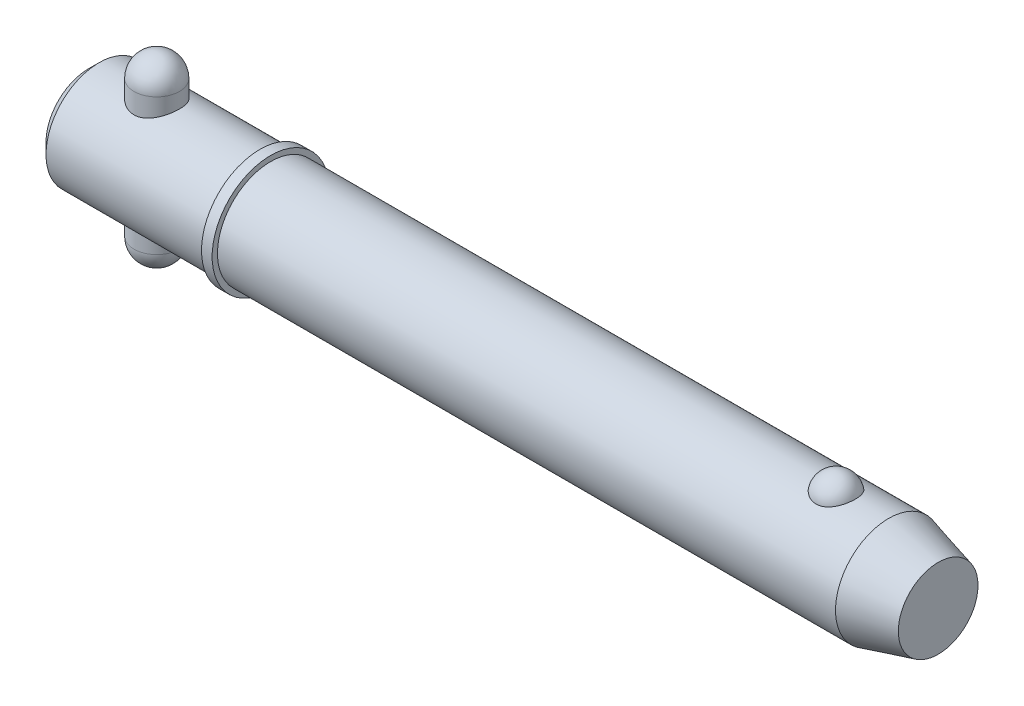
ISO-10303-21;
HEADER;
FILE_DESCRIPTION(('STEP AP214'),'2;1');
FILE_NAME('part.step','',(''),(''),'','','');
FILE_SCHEMA(('AUTOMOTIVE_DESIGN { 1 0 10303 214 1 1 1 1 }'));
ENDSEC;
DATA;
#1=APPLICATION_CONTEXT('core data for automotive mechanical design processes');
#2=APPLICATION_PROTOCOL_DEFINITION('international standard','automotive_design',2000,#1);
#3=PRODUCT_CONTEXT('',#1,'mechanical');
#4=PRODUCT('Part','Part','',(#3));
#5=PRODUCT_RELATED_PRODUCT_CATEGORY('part','',(#4));
#6=PRODUCT_DEFINITION_FORMATION('','',#4);
#7=PRODUCT_DEFINITION_CONTEXT('part definition',#1,'design');
#8=PRODUCT_DEFINITION('design','',#6,#7);
#9=PRODUCT_DEFINITION_SHAPE('','',#8);
#10=(LENGTH_UNIT() NAMED_UNIT(*) SI_UNIT(.MILLI.,.METRE.));
#11=(NAMED_UNIT(*) PLANE_ANGLE_UNIT() SI_UNIT($,.RADIAN.));
#12=(NAMED_UNIT(*) SI_UNIT($,.STERADIAN.) SOLID_ANGLE_UNIT());
#13=UNCERTAINTY_MEASURE_WITH_UNIT(LENGTH_MEASURE(1.E-05),#10,'distance_accuracy_value','');
#14=(GEOMETRIC_REPRESENTATION_CONTEXT(3) GLOBAL_UNCERTAINTY_ASSIGNED_CONTEXT((#13)) GLOBAL_UNIT_ASSIGNED_CONTEXT((#10,
#11,#12)) REPRESENTATION_CONTEXT('',''));
#15=CARTESIAN_POINT('',(0.,0.,0.));
#16=DIRECTION('',(0.,0.,1.));
#17=DIRECTION('',(1.,0.,0.));
#18=AXIS2_PLACEMENT_3D('',#15,#16,#17);
#19=CARTESIAN_POINT('',(14.28,19.05,0.));
#20=DIRECTION('',(0.,-1.,0.));
#21=DIRECTION('',(0.,0.,-1.));
#22=AXIS2_PLACEMENT_3D('',#19,#20,#21);
#23=CYLINDRICAL_SURFACE('',#22,4.76);
#24=CARTESIAN_POINT('',(14.28,-14.29,0.));
#25=DIRECTION('',(0.,-1.,0.));
#26=DIRECTION('',(0.,0.,-1.));
#27=AXIS2_PLACEMENT_3D('',#24,#25,#26);
#28=CIRCLE('',#27,4.76);
#29=CARTESIAN_POINT('',(14.28,-14.29,-4.76));
#30=VERTEX_POINT('',#29);
#31=EDGE_CURVE('P0_E10',#30,#30,#28,.F.);
#32=CARTESIAN_POINT('',(14.28,14.29,0.));
#33=DIRECTION('',(0.,-1.,0.));
#34=DIRECTION('',(0.,0.,-1.));
#35=AXIS2_PLACEMENT_3D('',#32,#33,#34);
#36=CIRCLE('',#35,4.76);
#37=CARTESIAN_POINT('',(14.28,14.29,-4.76));
#38=VERTEX_POINT('',#37);
#39=EDGE_CURVE('P0_E21',#38,#38,#36,.T.);
#40=CARTESIAN_POINT('',(14.28,-14.29,-4.76));
#41=CARTESIAN_POINT('',(14.28,-13.9922916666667,-4.76));
#42=CARTESIAN_POINT('',(14.28,-13.6945833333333,-4.76));
#43=CARTESIAN_POINT('',(14.28,-13.0991666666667,-4.76));
#44=CARTESIAN_POINT('',(14.28,-12.8014583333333,-4.76));
#45=CARTESIAN_POINT('',(14.28,-12.2060416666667,-4.76));
#46=CARTESIAN_POINT('',(14.28,-11.9083333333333,-4.76));
#47=CARTESIAN_POINT('',(14.28,-11.3129166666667,-4.76));
#48=CARTESIAN_POINT('',(14.28,-11.0152083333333,-4.76));
#49=CARTESIAN_POINT('',(14.28,-10.4197916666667,-4.76));
#50=CARTESIAN_POINT('',(14.28,-10.1220833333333,-4.76));
#51=CARTESIAN_POINT('',(14.28,-9.52666666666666,-4.76));
#52=CARTESIAN_POINT('',(14.28,-9.22895833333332,-4.76));
#53=CARTESIAN_POINT('',(14.28,-8.63354166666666,-4.76));
#54=CARTESIAN_POINT('',(14.28,-8.33583333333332,-4.76));
#55=CARTESIAN_POINT('',(14.28,-7.74041666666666,-4.76));
#56=CARTESIAN_POINT('',(14.28,-7.44270833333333,-4.76));
#57=CARTESIAN_POINT('',(14.28,-6.84729166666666,-4.76));
#58=CARTESIAN_POINT('',(14.28,-6.54958333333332,-4.76));
#59=CARTESIAN_POINT('',(14.28,-5.95416666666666,-4.76));
#60=CARTESIAN_POINT('',(14.28,-5.65645833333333,-4.76));
#61=CARTESIAN_POINT('',(14.28,-5.06104166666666,-4.76));
#62=CARTESIAN_POINT('',(14.28,-4.76333333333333,-4.76));
#63=CARTESIAN_POINT('',(14.28,-4.16791666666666,-4.76));
#64=CARTESIAN_POINT('',(14.28,-3.87020833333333,-4.76));
#65=CARTESIAN_POINT('',(14.28,-3.27479166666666,-4.76));
#66=CARTESIAN_POINT('',(14.28,-2.97708333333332,-4.76));
#67=CARTESIAN_POINT('',(14.28,-2.38166666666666,-4.76));
#68=CARTESIAN_POINT('',(14.28,-2.08395833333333,-4.76));
#69=CARTESIAN_POINT('',(14.28,-1.48854166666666,-4.76));
#70=CARTESIAN_POINT('',(14.28,-1.19083333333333,-4.76));
#71=CARTESIAN_POINT('',(14.28,-0.595416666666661,-4.76));
#72=CARTESIAN_POINT('',(14.28,-0.297708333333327,-4.76));
#73=CARTESIAN_POINT('',(14.28,0.297708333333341,-4.76));
#74=CARTESIAN_POINT('',(14.28,0.595416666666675,-4.76));
#75=CARTESIAN_POINT('',(14.28,1.19083333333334,-4.76));
#76=CARTESIAN_POINT('',(14.28,1.48854166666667,-4.76));
#77=CARTESIAN_POINT('',(14.28,2.08395833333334,-4.76));
#78=CARTESIAN_POINT('',(14.28,2.38166666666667,-4.76));
#79=CARTESIAN_POINT('',(14.28,2.97708333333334,-4.76));
#80=CARTESIAN_POINT('',(14.28,3.27479166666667,-4.76));
#81=CARTESIAN_POINT('',(14.28,3.87020833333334,-4.76));
#82=CARTESIAN_POINT('',(14.28,4.16791666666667,-4.76));
#83=CARTESIAN_POINT('',(14.28,4.76333333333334,-4.76));
#84=CARTESIAN_POINT('',(14.28,5.06104166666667,-4.76));
#85=CARTESIAN_POINT('',(14.28,5.65645833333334,-4.76));
#86=CARTESIAN_POINT('',(14.28,5.95416666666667,-4.76));
#87=CARTESIAN_POINT('',(14.28,6.54958333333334,-4.76));
#88=CARTESIAN_POINT('',(14.28,6.84729166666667,-4.76));
#89=CARTESIAN_POINT('',(14.28,7.44270833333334,-4.76));
#90=CARTESIAN_POINT('',(14.28,7.74041666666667,-4.76));
#91=CARTESIAN_POINT('',(14.28,8.33583333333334,-4.76));
#92=CARTESIAN_POINT('',(14.28,8.63354166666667,-4.76));
#93=CARTESIAN_POINT('',(14.28,9.22895833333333,-4.76));
#94=CARTESIAN_POINT('',(14.28,9.52666666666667,-4.76));
#95=CARTESIAN_POINT('',(14.28,10.1220833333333,-4.76));
#96=CARTESIAN_POINT('',(14.28,10.4197916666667,-4.76));
#97=CARTESIAN_POINT('',(14.28,11.0152083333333,-4.76));
#98=CARTESIAN_POINT('',(14.28,11.3129166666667,-4.76));
#99=CARTESIAN_POINT('',(14.28,11.9083333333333,-4.76));
#100=CARTESIAN_POINT('',(14.28,12.2060416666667,-4.76));
#101=CARTESIAN_POINT('',(14.28,12.8014583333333,-4.76));
#102=CARTESIAN_POINT('',(14.28,13.0991666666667,-4.76));
#103=CARTESIAN_POINT('',(14.28,13.6945833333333,-4.76));
#104=CARTESIAN_POINT('',(14.28,13.9922916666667,-4.76));
#105=CARTESIAN_POINT('',(14.28,14.29,-4.76));
#106=B_SPLINE_CURVE_WITH_KNOTS('',3,(#40,#41,#42,#43,#44,#45,#46,#47,#48,#49,#50,#51,#52,#53,
#54,#55,#56,#57,#58,#59,#60,#61,#62,#63,#64,#65,#66,#67,#68,#69,#70,#71,#72,#73,#74,#75,#76,#77,
#78,#79,#80,#81,#82,#83,#84,#85,#86,#87,#88,#89,#90,#91,#92,#93,#94,#95,#96,#97,#98,#99,#100,
#101,#102,#103,#104,#105),.UNSPECIFIED.,.F.,.F.,(4,2,2,2,2,2,2,2,2,2,2,2,2,2,2,2,2,2,2,2,2,2,2,
2,2,2,2,2,2,2,2,2,4),(0.,0.893125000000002,1.78625,2.67937499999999,3.5725,4.465625,5.35875,
6.25187499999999,7.145,8.038125,8.93125,9.82437499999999,10.7175,11.610625,12.50375,13.396875,
14.29,15.183125,16.07625,16.969375,17.8625,18.755625,19.64875,20.541875,21.435,22.328125,
23.22125,24.114375,25.0075,25.900625,26.79375,27.686875,28.58),.UNSPECIFIED.);
#107=EDGE_CURVE('P0_BSEAM14',#30,#38,#106,.T.);
#108=ORIENTED_EDGE('',*,*,#31,.T.);
#109=ORIENTED_EDGE('',*,*,#39,.T.);
#110=ORIENTED_EDGE('',*,*,#107,.T.);
#111=ORIENTED_EDGE('',*,*,#107,.F.);
#112=EDGE_LOOP('',(#108,#110,#109,#111));
#113=FACE_BOUND('',#112,.T.);
#114=ADVANCED_FACE('P0_F14',(#113),#23,.T.);
#115=CARTESIAN_POINT('',(14.28,-14.29,0.));
#116=DIRECTION('',(0.,0.,1.));
#117=DIRECTION('',(1.,0.,0.));
#118=AXIS2_PLACEMENT_3D('',#115,#116,#117);
#119=SPHERICAL_SURFACE('',#118,4.76);
#120=CARTESIAN_POINT('',(14.28,-14.29,0.));
#121=DIRECTION('',(0.,-1.,0.));
#122=DIRECTION('',(0.,0.,-1.));
#123=AXIS2_PLACEMENT_3D('',#120,#121,#122);
#124=SPHERICAL_SURFACE('',#123,4.76);
#125=ORIENTED_EDGE('',*,*,#31,.F.);
#126=EDGE_LOOP('',(#125));
#127=FACE_BOUND('',#126,.T.);
#128=ADVANCED_FACE('P0_F29',(#127),#124,.T.);
#129=CARTESIAN_POINT('',(14.28,14.29,0.));
#130=DIRECTION('',(0.,0.,1.));
#131=DIRECTION('',(1.,0.,0.));
#132=AXIS2_PLACEMENT_3D('',#129,#130,#131);
#133=SPHERICAL_SURFACE('',#132,4.76);
#134=CARTESIAN_POINT('',(14.28,14.29,0.));
#135=DIRECTION('',(0.,-1.,0.));
#136=DIRECTION('',(0.,0.,-1.));
#137=AXIS2_PLACEMENT_3D('',#134,#135,#136);
#138=SPHERICAL_SURFACE('',#137,4.76);
#139=ORIENTED_EDGE('',*,*,#39,.F.);
#140=EDGE_LOOP('',(#139));
#141=FACE_BOUND('',#140,.T.);
#142=ADVANCED_FACE('P0_F16',(#141),#138,.T.);
#143=CLOSED_SHELL('',(#114,#128,#142));
#144=MANIFOLD_SOLID_BREP('P0_B1',#143);
#145=CARTESIAN_POINT('',(0.,0.,0.));
#146=DIRECTION('',(1.,0.,0.));
#147=DIRECTION('',(0.,0.,-1.));
#148=AXIS2_PLACEMENT_3D('',#145,#146,#147);
#149=CYLINDRICAL_SURFACE('',#148,11.115);
#150=CARTESIAN_POINT('',(167.429563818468,0.,0.));
#151=DIRECTION('',(1.,0.,0.));
#152=DIRECTION('',(0.,0.,-1.));
#153=AXIS2_PLACEMENT_3D('',#150,#151,#152);
#154=CIRCLE('',#153,11.115);
#155=CARTESIAN_POINT('',(167.429563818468,0.,-11.115));
#156=VERTEX_POINT('',#155);
#157=EDGE_CURVE('P1_E81',#156,#156,#154,.T.);
#158=ORIENTED_EDGE('',*,*,#157,.F.);
#159=EDGE_LOOP('',(#158));
#160=FACE_BOUND('',#159,.T.);
#161=CARTESIAN_POINT('',(38.1,0.,0.));
#162=DIRECTION('',(1.,0.,0.));
#163=DIRECTION('',(0.,0.,-1.));
#164=AXIS2_PLACEMENT_3D('',#161,#162,#163);
#165=CIRCLE('',#164,11.115);
#166=CARTESIAN_POINT('',(38.1,0.,-11.115));
#167=VERTEX_POINT('',#166);
#168=EDGE_CURVE('P1_E85',#167,#167,#165,.T.);
#169=ORIENTED_EDGE('',*,*,#168,.T.);
#170=EDGE_LOOP('',(#169));
#171=FACE_BOUND('',#170,.T.);
#172=CARTESIAN_POINT('',(156.431068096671,10.3028087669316,4.17077409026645));
#173=CARTESIAN_POINT('',(156.214775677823,10.3028003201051,4.17078240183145));
#174=CARTESIAN_POINT('',(155.998548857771,10.3098895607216,4.15340593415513));
#175=CARTESIAN_POINT('',(155.572540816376,10.3373834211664,4.08449540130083));
#176=CARTESIAN_POINT('',(155.362757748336,10.3577841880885,4.0329712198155));
#177=CARTESIAN_POINT('',(154.955782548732,10.4095237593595,3.89746513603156));
#178=CARTESIAN_POINT('',(154.758572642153,10.4408466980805,3.81353029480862));
#179=CARTESIAN_POINT('',(154.381338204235,10.5110236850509,3.61560339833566));
#180=CARTESIAN_POINT('',(154.201317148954,10.5498792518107,3.50160528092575));
#181=CARTESIAN_POINT('',(153.857684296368,10.6322884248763,3.24292464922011));
#182=CARTESIAN_POINT('',(153.694686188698,10.6759443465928,3.09746040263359));
#183=CARTESIAN_POINT('',(153.394591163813,10.7625291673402,2.7817192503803));
#184=CARTESIAN_POINT('',(153.257499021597,10.8054579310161,2.61143778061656));
#185=CARTESIAN_POINT('',(153.006408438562,10.8881935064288,2.24226695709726));
#186=CARTESIAN_POINT('',(152.893710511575,10.9277761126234,2.04244123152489));
#187=CARTESIAN_POINT('',(152.701777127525,10.997484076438,1.62578254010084));
#188=CARTESIAN_POINT('',(152.622544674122,11.0276085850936,1.40894804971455));
#189=CARTESIAN_POINT('',(152.498303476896,11.0756732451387,0.961250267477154));
#190=CARTESIAN_POINT('',(152.453760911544,11.0934470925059,0.730239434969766));
#191=CARTESIAN_POINT('',(152.401569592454,11.1143331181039,0.263439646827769));
#192=CARTESIAN_POINT('',(152.393920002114,11.1174456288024,0.0276507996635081));
#193=CARTESIAN_POINT('',(152.41561056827,11.1087161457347,-0.440729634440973));
#194=CARTESIAN_POINT('',(152.444762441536,11.0969502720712,-0.6733313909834));
#195=CARTESIAN_POINT('',(152.539143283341,11.0597872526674,-1.12996621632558));
#196=CARTESIAN_POINT('',(152.604372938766,11.0343898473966,-1.35399912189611));
#197=CARTESIAN_POINT('',(152.76969844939,10.972515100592,-1.78750286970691));
#198=CARTESIAN_POINT('',(152.86983863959,10.9360236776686,-1.99695478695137));
#199=CARTESIAN_POINT('',(153.102940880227,10.8557595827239,-2.39520667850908));
#200=CARTESIAN_POINT('',(153.235905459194,10.8119863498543,-2.58400506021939));
#201=CARTESIAN_POINT('',(153.532407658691,10.7216733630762,-2.93635726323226));
#202=CARTESIAN_POINT('',(153.696056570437,10.675123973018,-3.09981510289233));
#203=CARTESIAN_POINT('',(154.049860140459,10.5846571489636,-3.39592247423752));
#204=CARTESIAN_POINT('',(154.240012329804,10.5407394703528,-3.52857487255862));
#205=CARTESIAN_POINT('',(154.63750141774,10.4616690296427,-3.75646057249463));
#206=CARTESIAN_POINT('',(154.84436705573,10.4263443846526,-3.85245432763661));
#207=CARTESIAN_POINT('',(155.272954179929,10.3675574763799,-4.00798747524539));
#208=CARTESIAN_POINT('',(155.494670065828,10.344090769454,-4.0675405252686));
#209=CARTESIAN_POINT('',(155.934669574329,10.3128282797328,-4.14614314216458));
#210=CARTESIAN_POINT('',(156.152565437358,10.3043040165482,-4.1670783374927));
#211=CARTESIAN_POINT('',(156.58894951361,10.3016771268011,-4.17357158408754));
#212=CARTESIAN_POINT('',(156.807437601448,10.3075716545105,-4.15913661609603));
#213=CARTESIAN_POINT('',(157.231744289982,10.3326686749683,-4.09636961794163));
#214=CARTESIAN_POINT('',(157.437745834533,10.3514555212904,-4.0490957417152));
#215=CARTESIAN_POINT('',(157.838576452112,10.399818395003,-3.92320197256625));
#216=CARTESIAN_POINT('',(158.0334046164,10.4293952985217,-3.84457953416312));
#217=CARTESIAN_POINT('',(158.411191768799,10.4969600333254,-3.65612410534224));
#218=CARTESIAN_POINT('',(158.593797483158,10.5351178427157,-3.54564545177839));
#219=CARTESIAN_POINT('',(158.938204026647,10.6154999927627,-3.29718036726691));
#220=CARTESIAN_POINT('',(159.100000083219,10.657725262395,-3.15918764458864));
#221=CARTESIAN_POINT('',(159.406959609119,10.744212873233,-2.85163580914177));
#222=CARTESIAN_POINT('',(159.550891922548,10.7884718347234,-2.68084605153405));
#223=CARTESIAN_POINT('',(159.809237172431,10.872374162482,-2.31721864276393));
#224=CARTESIAN_POINT('',(159.923644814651,10.9120167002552,-2.12437704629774));
#225=CARTESIAN_POINT('',(160.123873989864,10.9838919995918,-1.71516999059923));
#226=CARTESIAN_POINT('',(160.20866178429,11.0158465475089,-1.49824866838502));
#227=CARTESIAN_POINT('',(160.34268382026,11.0673523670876,-1.05228572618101));
#228=CARTESIAN_POINT('',(160.391917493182,11.086903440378,-0.823243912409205));
#229=CARTESIAN_POINT('',(160.453891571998,11.1116323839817,-0.359087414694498));
#230=CARTESIAN_POINT('',(160.466566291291,11.1167843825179,-0.123962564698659));
#231=CARTESIAN_POINT('',(160.454973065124,11.1121144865,0.345220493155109));
#232=CARTESIAN_POINT('',(160.430705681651,11.1022928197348,0.579278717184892));
#233=CARTESIAN_POINT('',(160.345907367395,11.0687504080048,1.03866534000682));
#234=CARTESIAN_POINT('',(160.285529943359,11.0450885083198,1.26402641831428));
#235=CARTESIAN_POINT('',(160.129853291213,10.9863185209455,1.70076772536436));
#236=CARTESIAN_POINT('',(160.034551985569,10.9512097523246,1.91214712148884));
#237=CARTESIAN_POINT('',(159.810397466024,10.8729733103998,2.316083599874));
#238=CARTESIAN_POINT('',(159.681380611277,10.8298068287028,2.50854240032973));
#239=CARTESIAN_POINT('',(159.392732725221,10.7401896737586,2.86808766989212));
#240=CARTESIAN_POINT('',(159.233102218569,10.6937390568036,3.03517457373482));
#241=CARTESIAN_POINT('',(158.887534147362,10.6029321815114,3.33857581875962));
#242=CARTESIAN_POINT('',(158.701708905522,10.5585680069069,3.47501541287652));
#243=CARTESIAN_POINT('',(158.307875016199,10.4769321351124,3.71390897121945));
#244=CARTESIAN_POINT('',(158.099863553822,10.439661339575,3.81635861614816));
#245=CARTESIAN_POINT('',(157.654066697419,10.3749407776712,3.98910631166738));
#246=CARTESIAN_POINT('',(157.415234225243,10.3482457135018,4.05700929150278));
#247=CARTESIAN_POINT('',(156.927925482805,10.312188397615,4.14782844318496));
#248=CARTESIAN_POINT('',(156.679453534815,10.3028184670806,4.17076454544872));
#249=CARTESIAN_POINT('',(156.431068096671,10.3028087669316,4.17077409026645));
#250=B_SPLINE_CURVE_WITH_KNOTS('',3,(#172,#173,#174,#175,#176,#177,#178,#179,#180,#181,#182,
#183,#184,#185,#186,#187,#188,#189,#190,#191,#192,#193,#194,#195,#196,#197,#198,#199,#200,#201,
#202,#203,#204,#205,#206,#207,#208,#209,#210,#211,#212,#213,#214,#215,#216,#217,#218,#219,#220,
#221,#222,#223,#224,#225,#226,#227,#228,#229,#230,#231,#232,#233,#234,#235,#236,#237,#238,#239,
#240,#241,#242,#243,#244,#245,#246,#247,#248,#249),.UNSPECIFIED.,.T.,.F.,(4,2,2,2,2,2,2,2,2,2,2,
2,2,2,2,2,2,2,2,2,2,2,2,2,2,2,2,2,2,2,2,2,2,2,2,2,2,2,4),(0.,0.64796614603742,1.29574482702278,
1.9425864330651,2.58955857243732,3.25496465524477,3.92049326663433,4.61566368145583,
5.31089647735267,6.01531821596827,6.71972398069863,7.42054043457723,8.12137023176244,
8.82309331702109,9.52487047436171,10.2292439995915,10.9335519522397,11.6223330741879,
12.3108558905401,12.9647664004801,13.6185478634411,14.252184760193,14.8858731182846,
15.5334360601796,16.1811472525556,16.8611459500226,17.5412664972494,18.2431855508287,
18.9451158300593,19.6483065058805,20.3514864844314,21.0516982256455,21.7519516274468,
22.4556690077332,23.1593743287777,23.860149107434,24.5610129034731,25.3054529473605,
26.049562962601),.UNSPECIFIED.);
#251=CARTESIAN_POINT('',(156.431068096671,10.3028087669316,4.17077409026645));
#252=VERTEX_POINT('',#251);
#253=EDGE_CURVE('P1_E35',#252,#252,#250,.T.);
#254=ORIENTED_EDGE('',*,*,#253,.T.);
#255=EDGE_LOOP('',(#254));
#256=FACE_BOUND('',#255,.T.);
#257=ADVANCED_FACE('P1_F13',(#160,#171,#256),#149,.T.);
#258=CARTESIAN_POINT('',(0.,0.,0.));
#259=DIRECTION('',(-1.,0.,0.));
#260=DIRECTION('',(0.,0.,1.));
#261=AXIS2_PLACEMENT_3D('',#258,#259,#260);
#262=PLANE('',#261);
#263=CARTESIAN_POINT('',(0.,0.,0.));
#264=DIRECTION('',(1.,0.,0.));
#265=DIRECTION('',(0.,0.,-1.));
#266=AXIS2_PLACEMENT_3D('',#263,#264,#265);
#267=CIRCLE('',#266,8.892);
#268=CARTESIAN_POINT('',(0.,0.,-8.892));
#269=VERTEX_POINT('',#268);
#270=EDGE_CURVE('P1_E9',#269,#269,#267,.T.);
#271=ORIENTED_EDGE('',*,*,#270,.F.);
#272=EDGE_LOOP('',(#271));
#273=FACE_BOUND('',#272,.T.);
#274=ADVANCED_FACE('P1_F15',(#273),#262,.T.);
#275=CARTESIAN_POINT('',(2.22299999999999,0.,0.));
#276=DIRECTION('',(1.,0.,0.));
#277=DIRECTION('',(0.,0.,-1.));
#278=AXIS2_PLACEMENT_3D('',#275,#276,#277);
#279=CONICAL_SURFACE('',#278,11.115,0.78539816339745);
#280=ORIENTED_EDGE('',*,*,#270,.T.);
#281=EDGE_LOOP('',(#280));
#282=FACE_BOUND('',#281,.T.);
#283=CARTESIAN_POINT('',(2.22299999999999,0.,0.));
#284=DIRECTION('',(1.,0.,0.));
#285=DIRECTION('',(0.,0.,-1.));
#286=AXIS2_PLACEMENT_3D('',#283,#284,#285);
#287=CIRCLE('',#286,11.115);
#288=CARTESIAN_POINT('',(2.22299999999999,0.,-11.115));
#289=VERTEX_POINT('',#288);
#290=EDGE_CURVE('P1_E26',#289,#289,#287,.T.);
#291=ORIENTED_EDGE('',*,*,#290,.F.);
#292=EDGE_LOOP('',(#291));
#293=FACE_BOUND('',#292,.T.);
#294=ADVANCED_FACE('P1_F77',(#282,#293),#279,.T.);
#295=CARTESIAN_POINT('',(0.,0.,0.));
#296=DIRECTION('',(1.,0.,0.));
#297=DIRECTION('',(0.,0.,-1.));
#298=AXIS2_PLACEMENT_3D('',#295,#296,#297);
#299=CYLINDRICAL_SURFACE('',#298,11.115);
#300=CARTESIAN_POINT('',(14.28,-10.0441836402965,4.76));
#301=CARTESIAN_POINT('',(14.1533731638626,-10.0441846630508,4.75999904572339));
#302=CARTESIAN_POINT('',(14.0267055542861,-10.0465865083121,4.75493985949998));
#303=CARTESIAN_POINT('',(13.774298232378,-10.0561141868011,4.73475585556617));
#304=CARTESIAN_POINT('',(13.6485591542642,-10.0632429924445,4.71962470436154));
#305=CARTESIAN_POINT('',(13.3987500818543,-10.0819979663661,4.67942666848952));
#306=CARTESIAN_POINT('',(13.2746840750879,-10.0936334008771,4.65433930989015));
#307=CARTESIAN_POINT('',(13.0293244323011,-10.1210146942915,4.59449317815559));
#308=CARTESIAN_POINT('',(12.9080319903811,-10.1367622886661,4.55973032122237));
#309=CARTESIAN_POINT('',(12.669614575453,-10.1717810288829,4.48106435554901));
#310=CARTESIAN_POINT('',(12.5524727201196,-10.1910352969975,4.4372048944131));
#311=CARTESIAN_POINT('',(12.3224300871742,-10.2325403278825,4.34063417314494));
#312=CARTESIAN_POINT('',(12.2095309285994,-10.2547922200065,4.28791957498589));
#313=CARTESIAN_POINT('',(11.8782785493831,-10.3250879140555,4.11715127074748));
#314=CARTESIAN_POINT('',(11.6670799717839,-10.3767168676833,3.98637638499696));
#315=CARTESIAN_POINT('',(11.2564039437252,-10.4874309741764,3.68567149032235));
#316=CARTESIAN_POINT('',(11.0583793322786,-10.5467772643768,3.51386978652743));
#317=CARTESIAN_POINT('',(10.6927724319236,-10.6641377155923,3.13969960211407));
#318=CARTESIAN_POINT('',(10.5252022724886,-10.7221513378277,2.93731900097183));
#319=CARTESIAN_POINT('',(10.2965609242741,-10.8050020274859,2.60935726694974));
#320=CARTESIAN_POINT('',(10.2227768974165,-10.8324811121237,2.49310321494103));
#321=CARTESIAN_POINT('',(10.0853380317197,-10.884703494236,2.25418999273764));
#322=CARTESIAN_POINT('',(10.0216789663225,-10.9094479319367,2.13153352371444));
#323=CARTESIAN_POINT('',(9.90506238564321,-10.9554932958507,1.88060370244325));
#324=CARTESIAN_POINT('',(9.85210574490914,-10.9767939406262,1.7523298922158));
#325=CARTESIAN_POINT('',(9.75746464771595,-11.0153112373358,1.49115740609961));
#326=CARTESIAN_POINT('',(9.71577447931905,-11.0325299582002,1.35826111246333));
#327=CARTESIAN_POINT('',(9.64605475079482,-11.0615607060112,1.09614539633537));
#328=CARTESIAN_POINT('',(9.61740732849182,-11.0736151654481,0.96711700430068));
#329=CARTESIAN_POINT('',(9.57092026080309,-11.0932687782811,0.706847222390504));
#330=CARTESIAN_POINT('',(9.55307574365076,-11.1008699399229,0.575606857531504));
#331=CARTESIAN_POINT('',(9.52838640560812,-11.1114054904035,0.31192917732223));
#332=CARTESIAN_POINT('',(9.52153986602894,-11.114340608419,0.179492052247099));
#333=CARTESIAN_POINT('',(9.51892405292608,-11.1154607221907,-0.0855090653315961));
#334=CARTESIAN_POINT('',(9.52315432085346,-11.1136459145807,-0.218073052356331));
#335=CARTESIAN_POINT('',(9.542009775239,-11.1055891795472,-0.473709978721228));
#336=CARTESIAN_POINT('',(9.55594693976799,-11.099640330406,-0.596843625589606));
#337=CARTESIAN_POINT('',(9.59332832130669,-11.0837823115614,-0.841440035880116));
#338=CARTESIAN_POINT('',(9.61677567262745,-11.0738718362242,-0.962902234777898));
#339=CARTESIAN_POINT('',(9.67294089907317,-11.0503378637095,-1.20325684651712));
#340=CARTESIAN_POINT('',(9.70565569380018,-11.0367156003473,-1.32215009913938));
#341=CARTESIAN_POINT('',(9.78005008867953,-11.0060908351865,-1.55666640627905));
#342=CARTESIAN_POINT('',(9.82173311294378,-10.9890870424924,-1.67228819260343));
#343=CARTESIAN_POINT('',(9.96110379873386,-10.9330280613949,-2.01656166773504));
#344=CARTESIAN_POINT('',(10.0722987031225,-10.8892801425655,-2.23915547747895));
#345=CARTESIAN_POINT('',(10.3268588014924,-10.7934745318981,-2.66299199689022));
#346=CARTESIAN_POINT('',(10.4702355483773,-10.7414138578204,-2.86422700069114));
#347=CARTESIAN_POINT('',(10.7973904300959,-10.6296201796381,-3.25557775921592));
#348=CARTESIAN_POINT('',(10.9833705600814,-10.569604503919,-3.443774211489));
#349=CARTESIAN_POINT('',(11.3844486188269,-10.4514707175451,-3.78722133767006));
#350=CARTESIAN_POINT('',(11.5995590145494,-10.3933534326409,-3.94245783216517));
#351=CARTESIAN_POINT('',(11.9444340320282,-10.311516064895,-4.14990014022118));
#352=CARTESIAN_POINT('',(12.0654579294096,-10.2847012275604,-4.21573894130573));
#353=CARTESIAN_POINT('',(12.3132718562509,-10.2342051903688,-4.33688518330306));
#354=CARTESIAN_POINT('',(12.4400593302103,-10.2105226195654,-4.39219723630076));
#355=CARTESIAN_POINT('',(12.6985418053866,-10.1671237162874,-4.49174500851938));
#356=CARTESIAN_POINT('',(12.8302359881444,-10.1474067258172,-4.53598256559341));
#357=CARTESIAN_POINT('',(13.0975061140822,-10.1126841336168,-4.61287629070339));
#358=CARTESIAN_POINT('',(13.233079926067,-10.0976759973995,-4.64553869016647));
#359=CARTESIAN_POINT('',(13.4978553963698,-10.0737863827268,-4.6971059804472));
#360=CARTESIAN_POINT('',(13.6268754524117,-10.0645618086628,-4.716785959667));
#361=CARTESIAN_POINT('',(13.8862990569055,-10.051062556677,-4.74548419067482));
#362=CARTESIAN_POINT('',(14.0167019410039,-10.0467856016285,-4.75450734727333));
#363=CARTESIAN_POINT('',(14.277859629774,-10.0433352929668,-4.76179143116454));
#364=CARTESIAN_POINT('',(14.4086143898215,-10.0441613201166,-4.76005366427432));
#365=CARTESIAN_POINT('',(14.6694025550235,-10.0508838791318,-4.74584231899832));
#366=CARTESIAN_POINT('',(14.7994359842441,-10.0567802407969,-4.73336910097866));
#367=CARTESIAN_POINT('',(15.0487369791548,-10.0728449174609,-4.69907984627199));
#368=CARTESIAN_POINT('',(15.1681238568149,-10.0826872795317,-4.67797462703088));
#369=CARTESIAN_POINT('',(15.4045894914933,-10.1062580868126,-4.62682977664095));
#370=CARTESIAN_POINT('',(15.5216674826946,-10.1199877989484,-4.59678723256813));
#371=CARTESIAN_POINT('',(15.868278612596,-10.1664161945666,-4.49365911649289));
#372=CARTESIAN_POINT('',(16.0933756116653,-10.2043671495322,-4.40754694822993));
#373=CARTESIAN_POINT('',(16.5357981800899,-10.2919879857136,-4.19898201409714));
#374=CARTESIAN_POINT('',(16.7523611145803,-10.3420954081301,-4.07511281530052));
#375=CARTESIAN_POINT('',(17.1627188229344,-10.4477911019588,-3.7959429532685));
#376=CARTESIAN_POINT('',(17.3565033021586,-10.5033818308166,-3.64062816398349));
#377=CARTESIAN_POINT('',(17.7334034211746,-10.6196376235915,-3.28693729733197));
#378=CARTESIAN_POINT('',(17.9141276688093,-10.6803237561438,-3.08599175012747));
#379=CARTESIAN_POINT('',(18.1582189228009,-10.7666348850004,-2.76320365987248));
#380=CARTESIAN_POINT('',(18.2351223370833,-10.7946346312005,-2.65197124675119));
#381=CARTESIAN_POINT('',(18.3793967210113,-10.8483267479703,-2.42297927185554));
#382=CARTESIAN_POINT('',(18.4467718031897,-10.87402011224,-2.30522255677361));
#383=CARTESIAN_POINT('',(18.5717669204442,-10.9225249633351,-2.06324665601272));
#384=CARTESIAN_POINT('',(18.6293326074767,-10.9453202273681,-1.93899615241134));
#385=CARTESIAN_POINT('',(18.73370006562,-10.9872100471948,-1.6855059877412));
#386=CARTESIAN_POINT('',(18.7805065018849,-11.0063062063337,-1.55626851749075));
#387=CARTESIAN_POINT('',(18.8628731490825,-11.0402419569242,-1.29375150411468));
#388=CARTESIAN_POINT('',(18.8984366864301,-11.0550828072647,-1.16047316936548));
#389=CARTESIAN_POINT('',(18.9579183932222,-11.0800638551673,-0.890912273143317));
#390=CARTESIAN_POINT('',(18.9818374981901,-11.0902044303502,-0.75462995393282));
#391=CARTESIAN_POINT('',(19.0164177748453,-11.104911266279,-0.490295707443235));
#392=CARTESIAN_POINT('',(19.027922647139,-11.1098318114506,-0.362373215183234));
#393=CARTESIAN_POINT('',(19.040554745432,-11.1152360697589,-0.105876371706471));
#394=CARTESIAN_POINT('',(19.0416784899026,-11.1157182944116,0.0226981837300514));
#395=CARTESIAN_POINT('',(19.0335275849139,-11.1122291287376,0.27938352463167));
#396=CARTESIAN_POINT('',(19.0242587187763,-11.1082602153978,0.407494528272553));
#397=CARTESIAN_POINT('',(18.9954320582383,-11.0959792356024,0.662388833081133));
#398=CARTESIAN_POINT('',(18.9758704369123,-11.0876655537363,0.789171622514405));
#399=CARTESIAN_POINT('',(18.9276379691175,-11.0673259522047,1.03545890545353));
#400=CARTESIAN_POINT('',(18.8993573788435,-11.0554596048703,1.15505309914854));
#401=CARTESIAN_POINT('',(18.8337694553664,-11.0282166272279,1.39134516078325));
#402=CARTESIAN_POINT('',(18.7964589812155,-11.0128387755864,1.5080420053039));
#403=CARTESIAN_POINT('',(18.671464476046,-10.9619666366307,1.85262797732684));
#404=CARTESIAN_POINT('',(18.5706772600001,-10.9217161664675,2.07521484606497));
#405=CARTESIAN_POINT('',(18.33202463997,-10.8301378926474,2.51061719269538));
#406=CARTESIAN_POINT('',(18.1926775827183,-10.7783885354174,2.72252375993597));
#407=CARTESIAN_POINT('',(17.8829747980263,-10.669863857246,3.12088015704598));
#408=CARTESIAN_POINT('',(17.7126068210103,-10.6130865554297,3.30731987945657));
#409=CARTESIAN_POINT('',(17.3310036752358,-10.495668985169,3.66358491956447));
#410=CARTESIAN_POINT('',(17.1177010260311,-10.4350471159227,3.83122543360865));
#411=CARTESIAN_POINT('',(16.7778915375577,-10.3495418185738,4.05420569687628));
#412=CARTESIAN_POINT('',(16.6612023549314,-10.3219229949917,4.12383380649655));
#413=CARTESIAN_POINT('',(16.4218466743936,-10.2693487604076,4.25306463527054));
#414=CARTESIAN_POINT('',(16.2991829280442,-10.2443921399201,4.31267191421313));
#415=CARTESIAN_POINT('',(16.0488008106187,-10.1979981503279,4.42126071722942));
#416=CARTESIAN_POINT('',(15.9210894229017,-10.1765561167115,4.47025635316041));
#417=CARTESIAN_POINT('',(15.6613937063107,-10.1379191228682,4.55720152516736));
#418=CARTESIAN_POINT('',(15.5294115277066,-10.1207220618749,4.59515652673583));
#419=CARTESIAN_POINT('',(15.2624981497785,-10.091252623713,4.65951684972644));
#420=CARTESIAN_POINT('',(15.1275757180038,-10.0789672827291,4.68595259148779));
#421=CARTESIAN_POINT('',(14.8556442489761,-10.0597530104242,4.72706206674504));
#422=CARTESIAN_POINT('',(14.7186368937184,-10.0528199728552,4.74174481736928));
#423=CARTESIAN_POINT('',(14.5310955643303,-10.047196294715,4.75363843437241));
#424=CARTESIAN_POINT('',(14.48091543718,-10.0460674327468,4.75602323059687));
#425=CARTESIAN_POINT('',(14.3804923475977,-10.044560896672,4.7592042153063));
#426=CARTESIAN_POINT('',(14.3302493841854,-10.0441832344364,4.76000037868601));
#427=CARTESIAN_POINT('',(14.28,-10.0441836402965,4.76));
#428=B_SPLINE_CURVE_WITH_KNOTS('',3,(#300,#301,#302,#303,#304,#305,#306,#307,#308,#309,#310,
#311,#312,#313,#314,#315,#316,#317,#318,#319,#320,#321,#322,#323,#324,#325,#326,#327,#328,#329,
#330,#331,#332,#333,#334,#335,#336,#337,#338,#339,#340,#341,#342,#343,#344,#345,#346,#347,#348,
#349,#350,#351,#352,#353,#354,#355,#356,#357,#358,#359,#360,#361,#362,#363,#364,#365,#366,#367,
#368,#369,#370,#371,#372,#373,#374,#375,#376,#377,#378,#379,#380,#381,#382,#383,#384,#385,#386,
#387,#388,#389,#390,#391,#392,#393,#394,#395,#396,#397,#398,#399,#400,#401,#402,#403,#404,#405,
#406,#407,#408,#409,#410,#411,#412,#413,#414,#415,#416,#417,#418,#419,#420,#421,#422,#423,#424,
#425,#426,#427),.UNSPECIFIED.,.T.,.F.,(4,2,2,2,2,2,2,2,2,2,2,2,2,2,2,2,2,2,2,2,2,2,2,2,2,2,2,2,
2,2,2,2,2,2,2,2,2,2,2,2,2,2,2,2,2,2,2,2,2,2,2,2,2,2,2,2,2,2,2,2,2,2,2,4),(0.,0.379828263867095,
0.759895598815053,1.14074858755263,1.52176256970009,1.90098898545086,2.28035867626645,
3.03818035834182,3.84125131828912,4.6446414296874,5.06541657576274,5.48601561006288,
5.90664899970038,6.3270687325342,6.72470503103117,7.12216187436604,7.51955659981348,
7.91693487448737,8.28868404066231,8.66055582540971,9.03230414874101,9.40419465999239,
10.1585834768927,10.9132435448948,11.7236471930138,12.5343987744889,12.9550196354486,
13.3754557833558,13.7958221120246,14.2159617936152,14.6079540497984,14.9997658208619,
15.3915300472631,15.7832811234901,16.1477615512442,16.512360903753,17.240999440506,
18.0012974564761,18.761937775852,19.5886929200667,20.0025782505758,20.4162843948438,
20.832212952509,21.2479608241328,21.6635855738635,22.0791769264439,22.4642880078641,
22.8495282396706,23.2345541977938,23.6197234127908,23.9896813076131,24.3597680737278,
25.099327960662,25.8726239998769,26.6462260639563,27.4759193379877,27.8914891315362,
28.3068693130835,28.7216936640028,29.1363123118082,29.5498292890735,29.9630287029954,
30.113753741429,30.2644811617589),.UNSPECIFIED.);
#429=CARTESIAN_POINT('',(14.28,-10.0441836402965,4.76));
#430=VERTEX_POINT('',#429);
#431=EDGE_CURVE('P1_E17',#430,#430,#428,.T.);
#432=ORIENTED_EDGE('',*,*,#431,.F.);
#433=EDGE_LOOP('',(#432));
#434=FACE_BOUND('',#433,.T.);
#435=CARTESIAN_POINT('',(14.28,10.0441836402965,4.76));
#436=CARTESIAN_POINT('',(14.4066268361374,10.0441846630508,4.75999904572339));
#437=CARTESIAN_POINT('',(14.5332944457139,10.0465865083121,4.75493985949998));
#438=CARTESIAN_POINT('',(14.785701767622,10.0561141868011,4.73475585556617));
#439=CARTESIAN_POINT('',(14.9114408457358,10.0632429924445,4.71962470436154));
#440=CARTESIAN_POINT('',(15.1612499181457,10.0819979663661,4.67942666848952));
#441=CARTESIAN_POINT('',(15.2853159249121,10.0936334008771,4.65433930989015));
#442=CARTESIAN_POINT('',(15.5306755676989,10.1210146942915,4.59449317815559));
#443=CARTESIAN_POINT('',(15.6519680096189,10.1367622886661,4.55973032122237));
#444=CARTESIAN_POINT('',(15.890385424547,10.1717810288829,4.48106435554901));
#445=CARTESIAN_POINT('',(16.0075272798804,10.1910352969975,4.4372048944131));
#446=CARTESIAN_POINT('',(16.2375699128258,10.2325403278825,4.34063417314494));
#447=CARTESIAN_POINT('',(16.3504690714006,10.2547922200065,4.28791957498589));
#448=CARTESIAN_POINT('',(16.6817214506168,10.3250879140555,4.11715127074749));
#449=CARTESIAN_POINT('',(16.8929200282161,10.3767168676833,3.98637638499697));
#450=CARTESIAN_POINT('',(17.3035960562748,10.4874309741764,3.68567149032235));
#451=CARTESIAN_POINT('',(17.5016206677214,10.5467772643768,3.51386978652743));
#452=CARTESIAN_POINT('',(17.8672275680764,10.6641377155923,3.13969960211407));
#453=CARTESIAN_POINT('',(18.0347977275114,10.7221513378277,2.93731900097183));
#454=CARTESIAN_POINT('',(18.2634390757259,10.8050020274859,2.60935726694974));
#455=CARTESIAN_POINT('',(18.3372231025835,10.8324811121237,2.49310321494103));
#456=CARTESIAN_POINT('',(18.4746619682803,10.884703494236,2.25418999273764));
#457=CARTESIAN_POINT('',(18.5383210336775,10.9094479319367,2.13153352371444));
#458=CARTESIAN_POINT('',(18.6549376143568,10.9554932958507,1.88060370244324));
#459=CARTESIAN_POINT('',(18.7078942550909,10.9767939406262,1.75232989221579));
#460=CARTESIAN_POINT('',(18.8025353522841,11.0153112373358,1.4911574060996));
#461=CARTESIAN_POINT('',(18.844225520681,11.0325299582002,1.35826111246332));
#462=CARTESIAN_POINT('',(18.9139452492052,11.0615607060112,1.09614539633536));
#463=CARTESIAN_POINT('',(18.9425926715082,11.0736151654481,0.967117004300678));
#464=CARTESIAN_POINT('',(18.9890797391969,11.0932687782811,0.706847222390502));
#465=CARTESIAN_POINT('',(19.0069242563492,11.1008699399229,0.575606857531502));
#466=CARTESIAN_POINT('',(19.0316135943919,11.1114054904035,0.311929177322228));
#467=CARTESIAN_POINT('',(19.0384601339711,11.114340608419,0.179492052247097));
#468=CARTESIAN_POINT('',(19.0410759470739,11.1154607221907,-0.0855090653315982));
#469=CARTESIAN_POINT('',(19.0368456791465,11.1136459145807,-0.218073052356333));
#470=CARTESIAN_POINT('',(19.017990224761,11.1055891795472,-0.47370997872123));
#471=CARTESIAN_POINT('',(19.004053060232,11.099640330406,-0.596843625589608));
#472=CARTESIAN_POINT('',(18.9666716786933,11.0837823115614,-0.841440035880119));
#473=CARTESIAN_POINT('',(18.9432243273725,11.0738718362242,-0.9629022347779));
#474=CARTESIAN_POINT('',(18.8870591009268,11.0503378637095,-1.20325684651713));
#475=CARTESIAN_POINT('',(18.8543443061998,11.0367156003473,-1.32215009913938));
#476=CARTESIAN_POINT('',(18.7799499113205,11.0060908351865,-1.55666640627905));
#477=CARTESIAN_POINT('',(18.7382668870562,10.9890870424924,-1.67228819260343));
#478=CARTESIAN_POINT('',(18.5988962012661,10.9330280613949,-2.01656166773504));
#479=CARTESIAN_POINT('',(18.4877012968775,10.8892801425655,-2.23915547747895));
#480=CARTESIAN_POINT('',(18.2331411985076,10.7934745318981,-2.66299199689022));
#481=CARTESIAN_POINT('',(18.0897644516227,10.7414138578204,-2.86422700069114));
#482=CARTESIAN_POINT('',(17.7626095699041,10.6296201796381,-3.25557775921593));
#483=CARTESIAN_POINT('',(17.5766294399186,10.569604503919,-3.443774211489));
#484=CARTESIAN_POINT('',(17.1755513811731,10.4514707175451,-3.78722133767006));
#485=CARTESIAN_POINT('',(16.9604409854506,10.3933534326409,-3.94245783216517));
#486=CARTESIAN_POINT('',(16.6155659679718,10.311516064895,-4.14990014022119));
#487=CARTESIAN_POINT('',(16.4945420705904,10.2847012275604,-4.21573894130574));
#488=CARTESIAN_POINT('',(16.2467281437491,10.2342051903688,-4.33688518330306));
#489=CARTESIAN_POINT('',(16.1199406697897,10.2105226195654,-4.39219723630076));
#490=CARTESIAN_POINT('',(15.8614581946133,10.1671237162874,-4.49174500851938));
#491=CARTESIAN_POINT('',(15.7297640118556,10.1474067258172,-4.53598256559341));
#492=CARTESIAN_POINT('',(15.4624938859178,10.1126841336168,-4.61287629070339));
#493=CARTESIAN_POINT('',(15.326920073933,10.0976759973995,-4.64553869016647));
#494=CARTESIAN_POINT('',(15.0621446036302,10.0737863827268,-4.6971059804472));
#495=CARTESIAN_POINT('',(14.9331245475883,10.0645618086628,-4.716785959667));
#496=CARTESIAN_POINT('',(14.6737009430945,10.051062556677,-4.74548419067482));
#497=CARTESIAN_POINT('',(14.543298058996,10.0467856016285,-4.75450734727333));
#498=CARTESIAN_POINT('',(14.2821403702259,10.0433352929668,-4.76179143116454));
#499=CARTESIAN_POINT('',(14.1513856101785,10.0441613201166,-4.76005366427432));
#500=CARTESIAN_POINT('',(13.8905974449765,10.0508838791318,-4.74584231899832));
#501=CARTESIAN_POINT('',(13.7605640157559,10.0567802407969,-4.73336910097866));
#502=CARTESIAN_POINT('',(13.5112630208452,10.0728449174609,-4.69907984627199));
#503=CARTESIAN_POINT('',(13.3918761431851,10.0826872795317,-4.67797462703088));
#504=CARTESIAN_POINT('',(13.1554105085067,10.1062580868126,-4.62682977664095));
#505=CARTESIAN_POINT('',(13.0383325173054,10.1199877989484,-4.59678723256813));
#506=CARTESIAN_POINT('',(12.691721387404,10.1664161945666,-4.49365911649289));
#507=CARTESIAN_POINT('',(12.4666243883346,10.2043671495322,-4.40754694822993));
#508=CARTESIAN_POINT('',(12.0242018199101,10.2919879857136,-4.19898201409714));
#509=CARTESIAN_POINT('',(11.8076388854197,10.3420954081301,-4.07511281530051));
#510=CARTESIAN_POINT('',(11.3972811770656,10.4477911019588,-3.7959429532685));
#511=CARTESIAN_POINT('',(11.2034966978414,10.5033818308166,-3.64062816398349));
#512=CARTESIAN_POINT('',(10.8265965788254,10.6196376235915,-3.28693729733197));
#513=CARTESIAN_POINT('',(10.6458723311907,10.6803237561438,-3.08599175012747));
#514=CARTESIAN_POINT('',(10.4017810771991,10.7666348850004,-2.76320365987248));
#515=CARTESIAN_POINT('',(10.3248776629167,10.7946346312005,-2.65197124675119));
#516=CARTESIAN_POINT('',(10.1806032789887,10.8483267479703,-2.42297927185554));
#517=CARTESIAN_POINT('',(10.1132281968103,10.87402011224,-2.30522255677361));
#518=CARTESIAN_POINT('',(9.98823307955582,10.9225249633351,-2.06324665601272));
#519=CARTESIAN_POINT('',(9.93066739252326,10.9453202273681,-1.93899615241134));
#520=CARTESIAN_POINT('',(9.82629993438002,10.9872100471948,-1.6855059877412));
#521=CARTESIAN_POINT('',(9.77949349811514,11.0063062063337,-1.55626851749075));
#522=CARTESIAN_POINT('',(9.69712685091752,11.0402419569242,-1.29375150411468));
#523=CARTESIAN_POINT('',(9.66156331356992,11.0550828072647,-1.16047316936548));
#524=CARTESIAN_POINT('',(9.60208160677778,11.0800638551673,-0.890912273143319));
#525=CARTESIAN_POINT('',(9.57816250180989,11.0902044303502,-0.754629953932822));
#526=CARTESIAN_POINT('',(9.54358222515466,11.104911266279,-0.490295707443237));
#527=CARTESIAN_POINT('',(9.53207735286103,11.1098318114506,-0.362373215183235));
#528=CARTESIAN_POINT('',(9.51944525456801,11.1152360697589,-0.105876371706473));
#529=CARTESIAN_POINT('',(9.51832151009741,11.1157182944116,0.0226981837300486));
#530=CARTESIAN_POINT('',(9.52647241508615,11.1122291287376,0.279383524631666));
#531=CARTESIAN_POINT('',(9.53574128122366,11.1082602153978,0.407494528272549));
#532=CARTESIAN_POINT('',(9.5645679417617,11.0959792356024,0.662388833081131));
#533=CARTESIAN_POINT('',(9.58412956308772,11.0876655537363,0.789171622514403));
#534=CARTESIAN_POINT('',(9.63236203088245,11.0673259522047,1.03545890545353));
#535=CARTESIAN_POINT('',(9.66064262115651,11.0554596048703,1.15505309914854));
#536=CARTESIAN_POINT('',(9.72623054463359,11.0282166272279,1.39134516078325));
#537=CARTESIAN_POINT('',(9.76354101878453,11.0128387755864,1.5080420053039));
#538=CARTESIAN_POINT('',(9.88853552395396,10.9619666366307,1.85262797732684));
#539=CARTESIAN_POINT('',(9.98932273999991,10.9217161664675,2.07521484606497));
#540=CARTESIAN_POINT('',(10.22797536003,10.8301378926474,2.51061719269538));
#541=CARTESIAN_POINT('',(10.3673224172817,10.7783885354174,2.72252375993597));
#542=CARTESIAN_POINT('',(10.6770252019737,10.669863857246,3.12088015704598));
#543=CARTESIAN_POINT('',(10.8473931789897,10.6130865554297,3.30731987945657));
#544=CARTESIAN_POINT('',(11.2289963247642,10.495668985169,3.66358491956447));
#545=CARTESIAN_POINT('',(11.4422989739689,10.4350471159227,3.83122543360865));
#546=CARTESIAN_POINT('',(11.7821084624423,10.3495418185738,4.05420569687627));
#547=CARTESIAN_POINT('',(11.8987976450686,10.3219229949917,4.12383380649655));
#548=CARTESIAN_POINT('',(12.1381533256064,10.2693487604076,4.25306463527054));
#549=CARTESIAN_POINT('',(12.2608170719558,10.2443921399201,4.31267191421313));
#550=CARTESIAN_POINT('',(12.5111991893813,10.1979981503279,4.42126071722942));
#551=CARTESIAN_POINT('',(12.6389105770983,10.1765561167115,4.47025635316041));
#552=CARTESIAN_POINT('',(12.8986062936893,10.1379191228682,4.55720152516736));
#553=CARTESIAN_POINT('',(13.0305884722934,10.1207220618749,4.59515652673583));
#554=CARTESIAN_POINT('',(13.2975018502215,10.091252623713,4.65951684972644));
#555=CARTESIAN_POINT('',(13.4324242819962,10.0789672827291,4.68595259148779));
#556=CARTESIAN_POINT('',(13.7043557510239,10.0597530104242,4.72706206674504));
#557=CARTESIAN_POINT('',(13.8413631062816,10.0528199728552,4.74174481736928));
#558=CARTESIAN_POINT('',(14.0289044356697,10.047196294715,4.75363843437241));
#559=CARTESIAN_POINT('',(14.07908456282,10.0460674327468,4.75602323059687));
#560=CARTESIAN_POINT('',(14.1795076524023,10.044560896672,4.7592042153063));
#561=CARTESIAN_POINT('',(14.2297506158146,10.0441832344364,4.76000037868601));
#562=CARTESIAN_POINT('',(14.28,10.0441836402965,4.76));
#563=B_SPLINE_CURVE_WITH_KNOTS('',3,(#435,#436,#437,#438,#439,#440,#441,#442,#443,#444,#445,
#446,#447,#448,#449,#450,#451,#452,#453,#454,#455,#456,#457,#458,#459,#460,#461,#462,#463,#464,
#465,#466,#467,#468,#469,#470,#471,#472,#473,#474,#475,#476,#477,#478,#479,#480,#481,#482,#483,
#484,#485,#486,#487,#488,#489,#490,#491,#492,#493,#494,#495,#496,#497,#498,#499,#500,#501,#502,
#503,#504,#505,#506,#507,#508,#509,#510,#511,#512,#513,#514,#515,#516,#517,#518,#519,#520,#521,
#522,#523,#524,#525,#526,#527,#528,#529,#530,#531,#532,#533,#534,#535,#536,#537,#538,#539,#540,
#541,#542,#543,#544,#545,#546,#547,#548,#549,#550,#551,#552,#553,#554,#555,#556,#557,#558,#559,
#560,#561,#562),.UNSPECIFIED.,.T.,.F.,(4,2,2,2,2,2,2,2,2,2,2,2,2,2,2,2,2,2,2,2,2,2,2,2,2,2,2,2,
2,2,2,2,2,2,2,2,2,2,2,2,2,2,2,2,2,2,2,2,2,2,2,2,2,2,2,2,2,2,2,2,2,2,2,4),(0.,0.379828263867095,
0.759895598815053,1.14074858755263,1.52176256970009,1.90098898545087,2.28035867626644,
3.03818035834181,3.84125131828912,4.6446414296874,5.06541657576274,5.48601561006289,
5.90664899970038,6.3270687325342,6.72470503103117,7.12216187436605,7.51955659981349,
7.91693487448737,8.28868404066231,8.66055582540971,9.03230414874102,9.4041946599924,
10.1585834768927,10.9132435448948,11.7236471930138,12.5343987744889,12.9550196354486,
13.3754557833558,13.7958221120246,14.2159617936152,14.6079540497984,14.9997658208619,
15.3915300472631,15.7832811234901,16.1477615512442,16.512360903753,17.240999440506,
18.0012974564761,18.761937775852,19.5886929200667,20.0025782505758,20.4162843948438,
20.832212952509,21.2479608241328,21.6635855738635,22.0791769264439,22.4642880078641,
22.8495282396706,23.2345541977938,23.6197234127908,23.9896813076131,24.3597680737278,
25.099327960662,25.8726239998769,26.6462260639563,27.4759193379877,27.8914891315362,
28.3068693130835,28.7216936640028,29.1363123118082,29.5498292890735,29.9630287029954,
30.113753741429,30.2644811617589),.UNSPECIFIED.);
#564=CARTESIAN_POINT('',(14.28,10.0441836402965,4.76));
#565=VERTEX_POINT('',#564);
#566=EDGE_CURVE('P1_E43',#565,#565,#563,.T.);
#567=ORIENTED_EDGE('',*,*,#566,.F.);
#568=EDGE_LOOP('',(#567));
#569=FACE_BOUND('',#568,.T.);
#570=ORIENTED_EDGE('',*,*,#290,.T.);
#571=EDGE_LOOP('',(#570));
#572=FACE_BOUND('',#571,.T.);
#573=CARTESIAN_POINT('',(35.877,0.,0.));
#574=DIRECTION('',(1.,0.,0.));
#575=DIRECTION('',(0.,0.,-1.));
#576=AXIS2_PLACEMENT_3D('',#573,#574,#575);
#577=CIRCLE('',#576,11.115);
#578=CARTESIAN_POINT('',(35.877,0.,-11.115));
#579=VERTEX_POINT('',#578);
#580=EDGE_CURVE('P1_E31',#579,#579,#577,.T.);
#581=ORIENTED_EDGE('',*,*,#580,.F.);
#582=EDGE_LOOP('',(#581));
#583=FACE_BOUND('',#582,.T.);
#584=ADVANCED_FACE('P1_F103',(#434,#569,#572,#583),#299,.T.);
#585=CARTESIAN_POINT('',(35.877,11.115,0.));
#586=DIRECTION('',(-1.,0.,0.));
#587=DIRECTION('',(0.,0.,1.));
#588=AXIS2_PLACEMENT_3D('',#585,#586,#587);
#589=PLANE('',#588);
#590=ORIENTED_EDGE('',*,*,#580,.T.);
#591=EDGE_LOOP('',(#590));
#592=FACE_BOUND('',#591,.T.);
#593=CARTESIAN_POINT('',(35.877,0.,0.));
#594=DIRECTION('',(1.,0.,0.));
#595=DIRECTION('',(0.,0.,-1.));
#596=AXIS2_PLACEMENT_3D('',#593,#594,#595);
#597=CIRCLE('',#596,12.2265);
#598=CARTESIAN_POINT('',(35.877,0.,-12.2265));
#599=VERTEX_POINT('',#598);
#600=EDGE_CURVE('P1_E91',#599,#599,#597,.T.);
#601=ORIENTED_EDGE('',*,*,#600,.F.);
#602=EDGE_LOOP('',(#601));
#603=FACE_BOUND('',#602,.T.);
#604=ADVANCED_FACE('P1_F100',(#592,#603),#589,.T.);
#605=CARTESIAN_POINT('',(0.,0.,0.));
#606=DIRECTION('',(1.,0.,0.));
#607=DIRECTION('',(0.,0.,-1.));
#608=AXIS2_PLACEMENT_3D('',#605,#606,#607);
#609=CYLINDRICAL_SURFACE('',#608,12.2265);
#610=ORIENTED_EDGE('',*,*,#600,.T.);
#611=EDGE_LOOP('',(#610));
#612=FACE_BOUND('',#611,.T.);
#613=CARTESIAN_POINT('',(38.1,0.,0.));
#614=DIRECTION('',(1.,0.,0.));
#615=DIRECTION('',(0.,0.,-1.));
#616=AXIS2_PLACEMENT_3D('',#613,#614,#615);
#617=CIRCLE('',#616,12.2265);
#618=CARTESIAN_POINT('',(38.1,0.,-12.2265));
#619=VERTEX_POINT('',#618);
#620=EDGE_CURVE('P1_E88',#619,#619,#617,.T.);
#621=ORIENTED_EDGE('',*,*,#620,.F.);
#622=EDGE_LOOP('',(#621));
#623=FACE_BOUND('',#622,.T.);
#624=ADVANCED_FACE('P1_F68',(#612,#623),#609,.T.);
#625=CARTESIAN_POINT('',(38.1,12.2265,0.));
#626=DIRECTION('',(1.,0.,0.));
#627=DIRECTION('',(0.,0.,-1.));
#628=AXIS2_PLACEMENT_3D('',#625,#626,#627);
#629=PLANE('',#628);
#630=ORIENTED_EDGE('',*,*,#620,.T.);
#631=EDGE_LOOP('',(#630));
#632=FACE_BOUND('',#631,.T.);
#633=ORIENTED_EDGE('',*,*,#168,.F.);
#634=EDGE_LOOP('',(#633));
#635=FACE_BOUND('',#634,.T.);
#636=ADVANCED_FACE('P1_F62',(#632,#635),#629,.T.);
#637=CARTESIAN_POINT('',(177.8,0.,0.));
#638=DIRECTION('',(-1.,0.,0.));
#639=DIRECTION('',(0.,0.,1.));
#640=AXIS2_PLACEMENT_3D('',#637,#638,#639);
#641=CONICAL_SURFACE('',#640,8.33625000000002,0.261799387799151);
#642=ORIENTED_EDGE('',*,*,#157,.T.);
#643=EDGE_LOOP('',(#642));
#644=FACE_BOUND('',#643,.T.);
#645=CARTESIAN_POINT('',(177.8,0.,0.));
#646=DIRECTION('',(1.,0.,0.));
#647=DIRECTION('',(0.,0.,-1.));
#648=AXIS2_PLACEMENT_3D('',#645,#646,#647);
#649=CIRCLE('',#648,8.33625000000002);
#650=CARTESIAN_POINT('',(177.8,0.,-8.33625000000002));
#651=VERTEX_POINT('',#650);
#652=EDGE_CURVE('P1_E42',#651,#651,#649,.T.);
#653=ORIENTED_EDGE('',*,*,#652,.F.);
#654=EDGE_LOOP('',(#653));
#655=FACE_BOUND('',#654,.T.);
#656=ADVANCED_FACE('P1_F59',(#644,#655),#641,.T.);
#657=CARTESIAN_POINT('',(177.8,8.33625000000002,0.));
#658=DIRECTION('',(1.,0.,0.));
#659=DIRECTION('',(0.,0.,-1.));
#660=AXIS2_PLACEMENT_3D('',#657,#658,#659);
#661=PLANE('',#660);
#662=ORIENTED_EDGE('',*,*,#652,.T.);
#663=EDGE_LOOP('',(#662));
#664=FACE_BOUND('',#663,.T.);
#665=ADVANCED_FACE('P1_F55',(#664),#661,.T.);
#666=CARTESIAN_POINT('',(156.431068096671,10.0035,0.));
#667=DIRECTION('',(-1.,0.,0.));
#668=DIRECTION('',(0.,1.,0.));
#669=AXIS2_PLACEMENT_3D('',#666,#667,#668);
#670=SPHERICAL_SURFACE('',#669,4.18150000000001);
#671=ORIENTED_EDGE('',*,*,#253,.F.);
#672=EDGE_LOOP('',(#671));
#673=FACE_BOUND('',#672,.T.);
#674=ADVANCED_FACE('P1_F50',(#673),#670,.T.);
#675=CARTESIAN_POINT('',(14.28,-12.2265,0.));
#676=DIRECTION('',(0.,1.,0.));
#677=DIRECTION('',(0.,0.,1.));
#678=AXIS2_PLACEMENT_3D('',#675,#676,#677);
#679=CYLINDRICAL_SURFACE('',#678,4.76);
#680=ORIENTED_EDGE('',*,*,#431,.T.);
#681=EDGE_LOOP('',(#680));
#682=FACE_BOUND('',#681,.T.);
#683=ORIENTED_EDGE('',*,*,#566,.T.);
#684=EDGE_LOOP('',(#683));
#685=FACE_BOUND('',#684,.T.);
#686=ADVANCED_FACE('P1_F54',(#682,#685),#679,.F.);
#687=CLOSED_SHELL('',(#257,#274,#294,#584,#604,#624,#636,#656,#665,#674,#686));
#688=MANIFOLD_SOLID_BREP('P1_B1',#687);
#689=ADVANCED_BREP_SHAPE_REPRESENTATION('',(#18,#144,#688),#14);
#690=SHAPE_DEFINITION_REPRESENTATION(#9,#689);
ENDSEC;
END-ISO-10303-21;
